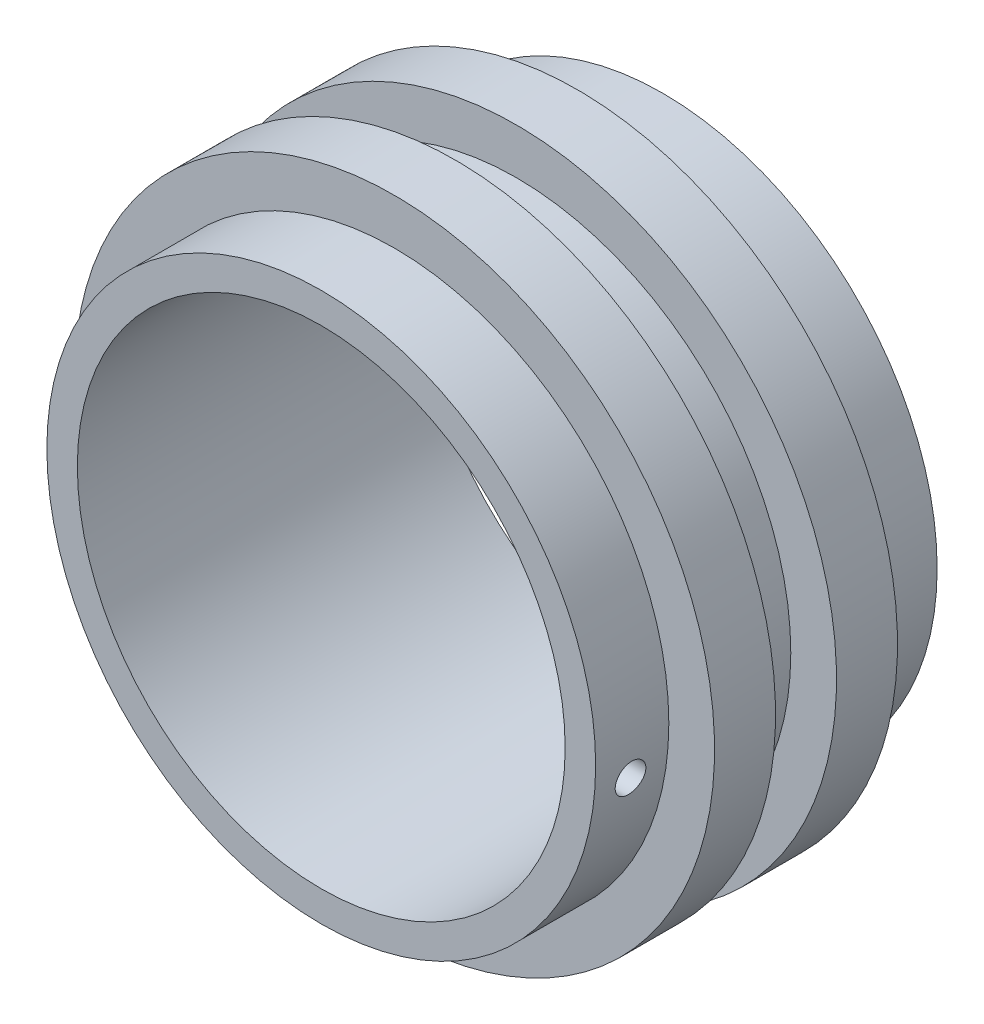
from build123d import *

# Parameters (mm, degrees)
SKETCH2_R           = 57.15
BOSS_EXTRUDE1_DEPTH = 152.4
SKETCH3_R           = 50.8
CUT_EXTRUDE1_DEPTH  = 152.4
SKETCH34_W          = 152.4
SKETCH34_H          = 25.4
BOSS_EXTRUDE3_DEPTH = 25.4
SKETCH35_R          = 8.255
CUT_EXTRUDE2_DEPTH  = 30.48
BOSS_EXTRUDE4_START = -99.06
SKETCH37_R          = 66.675
SKETCH37_R_2        = 57.15
BOSS_EXTRUDE4_DEPTH = 12.7
BOSS_EXTRUDE5_START = -71.12
SKETCH38_R          = 66.675
SKETCH38_R_2        = 57.15
BOSS_EXTRUDE5_DEPTH = 12.7
BOSS_EXTRUDE6_START = -43.18
SKETCH39_R          = 66.675
SKETCH39_R_2        = 57.15
BOSS_EXTRUDE6_DEPTH = 12.7
BOSS_EXTRUDE7_START = -17.78
SKETCH40_R          = 66.675
SKETCH40_R_2        = 57.15
BOSS_EXTRUDE7_DEPTH = 12.7
SKETCH42_R          = 3.175
CUT_EXTRUDE4_DEPTH  = 101.6
SKETCH41_W          = 81.28
SKETCH41_H          = 147.322635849
CUT_EXTRUDE5_DEPTH  = 199.136


with BuildPart() as part:
    # Sketch2 → Boss-Extrude1 (new body)
    with BuildSketch(Plane.XY):
        with Locations(Location((0, 0, 0), (0, 0, 180))):
            Circle(SKETCH2_R)
    extrude(amount=BOSS_EXTRUDE1_DEPTH)

    # Sketch3 → Cut-Extrude1 (cut)
    with BuildSketch(Plane.XY.offset(152.4)):
        Circle(SKETCH3_R)
    extrude(amount=-CUT_EXTRUDE1_DEPTH, mode=Mode.SUBTRACT)

    # Sketch34 → Boss-Extrude3 (add)
    with BuildSketch(Plane.XY.offset(152.4)):
        with Locations((0, -63.5)):
            Rectangle(SKETCH34_W, SKETCH34_H)
    extrude(amount=-BOSS_EXTRUDE3_DEPTH)

    # Sketch35 → Cut-Extrude2 (cut)
    with BuildSketch(Plane.XY.offset(152.4)):
        with Locations((-63.5, -63.5)):
            Circle(SKETCH35_R)
        with Locations((63.5, -63.5)):
            Circle(SKETCH35_R)
    extrude(amount=-CUT_EXTRUDE2_DEPTH, mode=Mode.SUBTRACT)

    # Sketch37 → Boss-Extrude4 (add)
    with BuildSketch(Plane(origin=(0, 0, 0), x_dir=(-1, 0, 0), z_dir=(0, 0, -1)).offset(BOSS_EXTRUDE4_START)):
        Circle(SKETCH37_R)
        Circle(SKETCH37_R_2, mode=Mode.SUBTRACT)
    extrude(amount=-BOSS_EXTRUDE4_DEPTH)

    # Sketch38 → Boss-Extrude5 (add)
    with BuildSketch(Plane(origin=(0, 0, 0), x_dir=(-1, 0, 0), z_dir=(0, 0, -1)).offset(BOSS_EXTRUDE5_START)):
        Circle(SKETCH38_R)
        Circle(SKETCH38_R_2, mode=Mode.SUBTRACT)
    extrude(amount=-BOSS_EXTRUDE5_DEPTH)

    # Sketch39 → Boss-Extrude6 (add)
    with BuildSketch(Plane(origin=(0, 0, 0), x_dir=(-1, 0, 0), z_dir=(0, 0, -1)).offset(BOSS_EXTRUDE6_START)):
        Circle(SKETCH39_R)
        Circle(SKETCH39_R_2, mode=Mode.SUBTRACT)
    extrude(amount=-BOSS_EXTRUDE6_DEPTH)

    # Sketch40 → Boss-Extrude7 (add)
    with BuildSketch(Plane(origin=(0, 0, 0), x_dir=(-1, 0, 0), z_dir=(0, 0, -1)).offset(BOSS_EXTRUDE7_START)):
        Circle(SKETCH40_R)
        Circle(SKETCH40_R_2, mode=Mode.SUBTRACT)
    extrude(amount=-BOSS_EXTRUDE7_DEPTH)

    # Sketch42 → Cut-Extrude4 (cut)
    with BuildSketch(Plane(origin=(76.2, 0, 0), x_dir=(0, 0, -1), z_dir=(1, 0, 0))):
        with Locations(Location((-63.518764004, -6.231569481, 0), (0, 0, 90))):
            Circle(SKETCH42_R)
        with Locations(Location((-36.848764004, -6.231569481, 0), (0, 0, 90))):
            Circle(SKETCH42_R)
    extrude(amount=-CUT_EXTRUDE4_DEPTH, mode=Mode.SUBTRACT)

    # Sketch41 → Cut-Extrude5 (cut)
    with BuildSketch(Plane(origin=(76.2, 0, 0), x_dir=(0, 0, -1), z_dir=(1, 0, 0))):
        with Locations((-111.76, -2.538682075)):
            Rectangle(SKETCH41_W, SKETCH41_H)
    extrude(amount=-CUT_EXTRUDE5_DEPTH, mode=Mode.SUBTRACT)


solid = part.part
